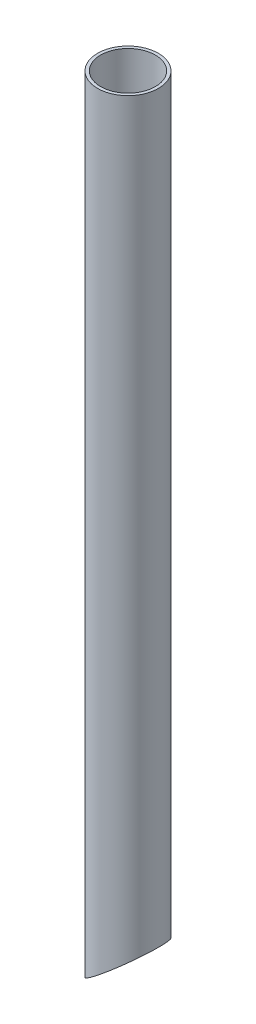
ISO-10303-21;
HEADER;
FILE_DESCRIPTION(('STEP AP214'),'2;1');
FILE_NAME('part.step','',(''),(''),'','','');
FILE_SCHEMA(('AUTOMOTIVE_DESIGN { 1 0 10303 214 1 1 1 1 }'));
ENDSEC;
DATA;
#1=APPLICATION_CONTEXT('core data for automotive mechanical design processes');
#2=APPLICATION_PROTOCOL_DEFINITION('international standard','automotive_design',2000,#1);
#3=PRODUCT_CONTEXT('',#1,'mechanical');
#4=PRODUCT('Part','Part','',(#3));
#5=PRODUCT_RELATED_PRODUCT_CATEGORY('part','',(#4));
#6=PRODUCT_DEFINITION_FORMATION('','',#4);
#7=PRODUCT_DEFINITION_CONTEXT('part definition',#1,'design');
#8=PRODUCT_DEFINITION('design','',#6,#7);
#9=PRODUCT_DEFINITION_SHAPE('','',#8);
#10=(LENGTH_UNIT() NAMED_UNIT(*) SI_UNIT(.MILLI.,.METRE.));
#11=(NAMED_UNIT(*) PLANE_ANGLE_UNIT() SI_UNIT($,.RADIAN.));
#12=(NAMED_UNIT(*) SI_UNIT($,.STERADIAN.) SOLID_ANGLE_UNIT());
#13=UNCERTAINTY_MEASURE_WITH_UNIT(LENGTH_MEASURE(1.E-05),#10,'distance_accuracy_value','');
#14=(GEOMETRIC_REPRESENTATION_CONTEXT(3) GLOBAL_UNCERTAINTY_ASSIGNED_CONTEXT((#13)) GLOBAL_UNIT_ASSIGNED_CONTEXT((#10,
#11,#12)) REPRESENTATION_CONTEXT('',''));
#15=CARTESIAN_POINT('',(0.,0.,0.));
#16=DIRECTION('',(0.,0.,1.));
#17=DIRECTION('',(1.,0.,0.));
#18=AXIS2_PLACEMENT_3D('',#15,#16,#17);
#19=CARTESIAN_POINT('',(0.,400.,0.));
#20=DIRECTION('',(0.,1.,0.));
#21=DIRECTION('',(0.,0.,1.));
#22=AXIS2_PLACEMENT_3D('',#19,#20,#21);
#23=PLANE('',#22);
#24=CARTESIAN_POINT('',(0.,400.,0.));
#25=DIRECTION('',(0.,1.,0.));
#26=DIRECTION('',(0.,0.,1.));
#27=AXIS2_PLACEMENT_3D('',#24,#25,#26);
#28=CIRCLE('',#27,15.);
#29=CARTESIAN_POINT('',(0.,400.,15.));
#30=VERTEX_POINT('',#29);
#31=EDGE_CURVE('E11',#30,#30,#28,.T.);
#32=ORIENTED_EDGE('',*,*,#31,.T.);
#33=EDGE_LOOP('',(#32));
#34=FACE_BOUND('',#33,.T.);
#35=CARTESIAN_POINT('',(0.,400.,0.));
#36=DIRECTION('',(0.,1.,0.));
#37=DIRECTION('',(1.,0.,0.));
#38=AXIS2_PLACEMENT_3D('',#35,#36,#37);
#39=CIRCLE('',#38,13.5);
#40=CARTESIAN_POINT('',(13.5,400.,0.));
#41=VERTEX_POINT('',#40);
#42=EDGE_CURVE('E49',#41,#41,#39,.T.);
#43=ORIENTED_EDGE('',*,*,#42,.F.);
#44=EDGE_LOOP('',(#43));
#45=FACE_BOUND('',#44,.T.);
#46=ADVANCED_FACE('F41',(#34,#45),#23,.T.);
#47=CARTESIAN_POINT('',(0.,400.,0.));
#48=DIRECTION('',(0.,-1.,0.));
#49=DIRECTION('',(0.,0.,-1.));
#50=AXIS2_PLACEMENT_3D('',#47,#48,#49);
#51=CYLINDRICAL_SURFACE('',#50,15.);
#52=ORIENTED_EDGE('',*,*,#31,.F.);
#53=EDGE_LOOP('',(#52));
#54=FACE_BOUND('',#53,.T.);
#55=CARTESIAN_POINT('',(0.,21.4222201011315,0.));
#56=DIRECTION('',(-0.621264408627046,0.783601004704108,0.));
#57=DIRECTION('',(-0.783601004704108,-0.621264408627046,0.));
#58=AXIS2_PLACEMENT_3D('',#55,#56,#57);
#59=ELLIPSE('',#58,19.1423950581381,15.);
#60=CARTESIAN_POINT('',(-15.,9.52973135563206,0.));
#61=VERTEX_POINT('',#60);
#62=EDGE_CURVE('E53',#61,#61,#59,.T.);
#63=ORIENTED_EDGE('',*,*,#62,.T.);
#64=EDGE_LOOP('',(#63));
#65=FACE_BOUND('',#64,.T.);
#66=ADVANCED_FACE('F43',(#54,#65),#51,.T.);
#67=CARTESIAN_POINT('',(0.,400.,0.));
#68=DIRECTION('',(0.,-1.,0.));
#69=DIRECTION('',(0.,0.,-1.));
#70=AXIS2_PLACEMENT_3D('',#67,#68,#69);
#71=CYLINDRICAL_SURFACE('',#70,13.5);
#72=CARTESIAN_POINT('',(0.,21.4222201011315,0.));
#73=DIRECTION('',(-0.621264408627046,0.783601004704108,0.));
#74=DIRECTION('',(-0.783601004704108,-0.621264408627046,0.));
#75=AXIS2_PLACEMENT_3D('',#72,#73,#74);
#76=ELLIPSE('',#75,17.2281555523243,13.5);
#77=CARTESIAN_POINT('',(-13.5,10.718980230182,0.));
#78=VERTEX_POINT('',#77);
#79=EDGE_CURVE('E45',#78,#78,#76,.T.);
#80=ORIENTED_EDGE('',*,*,#79,.F.);
#81=EDGE_LOOP('',(#80));
#82=FACE_BOUND('',#81,.T.);
#83=ORIENTED_EDGE('',*,*,#42,.T.);
#84=EDGE_LOOP('',(#83));
#85=FACE_BOUND('',#84,.T.);
#86=ADVANCED_FACE('F65',(#82,#85),#71,.F.);
#87=CARTESIAN_POINT('',(-19.2739270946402,6.14122269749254,-15.));
#88=DIRECTION('',(-0.621264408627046,0.783601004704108,0.));
#89=DIRECTION('',(-0.783601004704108,-0.621264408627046,0.));
#90=AXIS2_PLACEMENT_3D('',#87,#88,#89);
#91=PLANE('',#90);
#92=ORIENTED_EDGE('',*,*,#79,.T.);
#93=EDGE_LOOP('',(#92));
#94=FACE_BOUND('',#93,.T.);
#95=ORIENTED_EDGE('',*,*,#62,.F.);
#96=EDGE_LOOP('',(#95));
#97=FACE_BOUND('',#96,.T.);
#98=ADVANCED_FACE('F62',(#94,#97),#91,.F.);
#99=CLOSED_SHELL('',(#46,#66,#86,#98));
#100=MANIFOLD_SOLID_BREP('B2',#99);
#101=ADVANCED_BREP_SHAPE_REPRESENTATION('',(#18,#100),#14);
#102=SHAPE_DEFINITION_REPRESENTATION(#9,#101);
ENDSEC;
END-ISO-10303-21;
